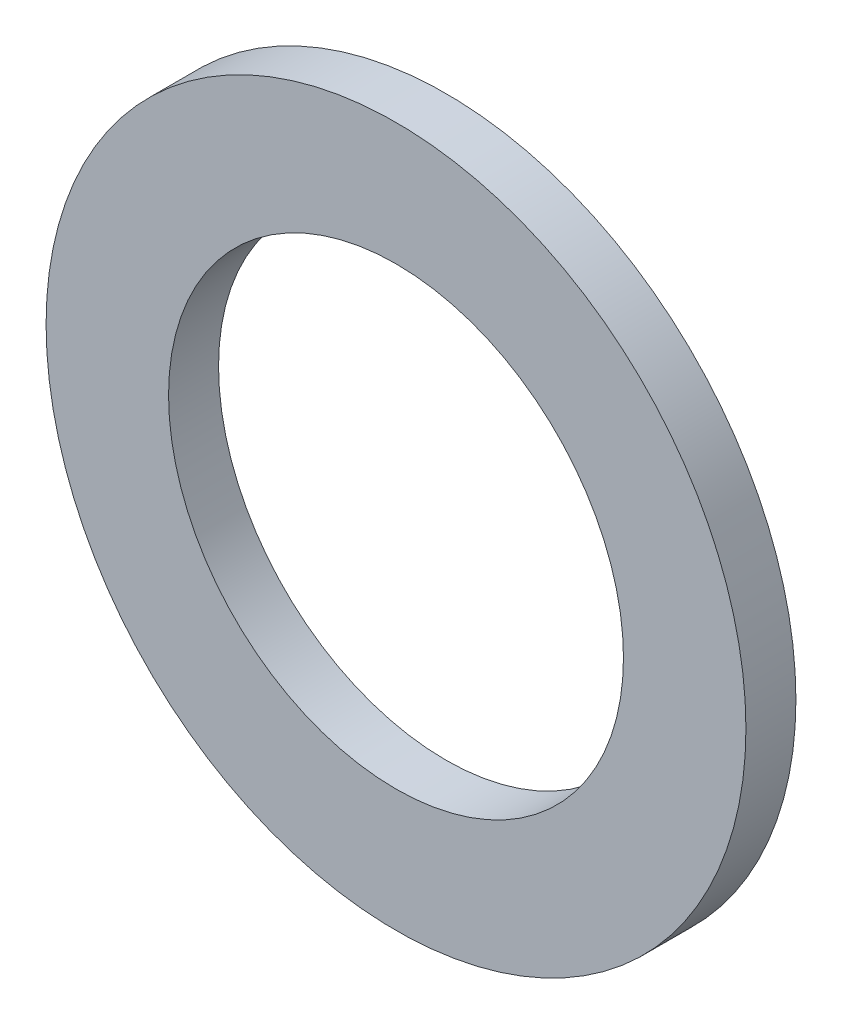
ISO-10303-21;
HEADER;
FILE_DESCRIPTION(('STEP AP214'),'2;1');
FILE_NAME('part.step','',(''),(''),'','','');
FILE_SCHEMA(('AUTOMOTIVE_DESIGN { 1 0 10303 214 1 1 1 1 }'));
ENDSEC;
DATA;
#1=APPLICATION_CONTEXT('core data for automotive mechanical design processes');
#2=APPLICATION_PROTOCOL_DEFINITION('international standard','automotive_design',2000,#1);
#3=PRODUCT_CONTEXT('',#1,'mechanical');
#4=PRODUCT('Part','Part','',(#3));
#5=PRODUCT_RELATED_PRODUCT_CATEGORY('part','',(#4));
#6=PRODUCT_DEFINITION_FORMATION('','',#4);
#7=PRODUCT_DEFINITION_CONTEXT('part definition',#1,'design');
#8=PRODUCT_DEFINITION('design','',#6,#7);
#9=PRODUCT_DEFINITION_SHAPE('','',#8);
#10=(LENGTH_UNIT() NAMED_UNIT(*) SI_UNIT(.MILLI.,.METRE.));
#11=(NAMED_UNIT(*) PLANE_ANGLE_UNIT() SI_UNIT($,.RADIAN.));
#12=(NAMED_UNIT(*) SI_UNIT($,.STERADIAN.) SOLID_ANGLE_UNIT());
#13=UNCERTAINTY_MEASURE_WITH_UNIT(LENGTH_MEASURE(1.E-05),#10,'distance_accuracy_value','');
#14=(GEOMETRIC_REPRESENTATION_CONTEXT(3) GLOBAL_UNCERTAINTY_ASSIGNED_CONTEXT((#13)) GLOBAL_UNIT_ASSIGNED_CONTEXT((#10,
#11,#12)) REPRESENTATION_CONTEXT('',''));
#15=CARTESIAN_POINT('',(0.,0.,0.));
#16=DIRECTION('',(0.,0.,1.));
#17=DIRECTION('',(1.,0.,0.));
#18=AXIS2_PLACEMENT_3D('',#15,#16,#17);
#19=CARTESIAN_POINT('',(0.,0.,2.));
#20=DIRECTION('',(0.,0.,1.));
#21=DIRECTION('',(1.,0.,0.));
#22=AXIS2_PLACEMENT_3D('',#19,#20,#21);
#23=PLANE('',#22);
#24=CARTESIAN_POINT('',(0.,0.,2.));
#25=DIRECTION('',(0.,0.,1.));
#26=DIRECTION('',(1.,0.,0.));
#27=AXIS2_PLACEMENT_3D('',#24,#25,#26);
#28=CIRCLE('',#27,14.);
#29=CARTESIAN_POINT('',(14.,0.,2.));
#30=VERTEX_POINT('',#29);
#31=EDGE_CURVE('E10',#30,#30,#28,.T.);
#32=ORIENTED_EDGE('',*,*,#31,.T.);
#33=EDGE_LOOP('',(#32));
#34=FACE_BOUND('',#33,.T.);
#35=CARTESIAN_POINT('',(0.,0.,2.));
#36=DIRECTION('',(0.,0.,1.));
#37=DIRECTION('',(1.,0.,0.));
#38=AXIS2_PLACEMENT_3D('',#35,#36,#37);
#39=CIRCLE('',#38,9.1);
#40=CARTESIAN_POINT('',(9.1,0.,2.));
#41=VERTEX_POINT('',#40);
#42=EDGE_CURVE('E40',#41,#41,#39,.T.);
#43=ORIENTED_EDGE('',*,*,#42,.F.);
#44=EDGE_LOOP('',(#43));
#45=FACE_BOUND('',#44,.T.);
#46=ADVANCED_FACE('F29',(#34,#45),#23,.T.);
#47=CARTESIAN_POINT('',(0.,0.,0.));
#48=DIRECTION('',(0.,0.,1.));
#49=DIRECTION('',(1.,0.,0.));
#50=AXIS2_PLACEMENT_3D('',#47,#48,#49);
#51=PLANE('',#50);
#52=CARTESIAN_POINT('',(0.,0.,0.));
#53=DIRECTION('',(0.,0.,1.));
#54=DIRECTION('',(1.,0.,0.));
#55=AXIS2_PLACEMENT_3D('',#52,#53,#54);
#56=CIRCLE('',#55,14.);
#57=CARTESIAN_POINT('',(14.,0.,0.));
#58=VERTEX_POINT('',#57);
#59=EDGE_CURVE('E36',#58,#58,#56,.T.);
#60=ORIENTED_EDGE('',*,*,#59,.F.);
#61=EDGE_LOOP('',(#60));
#62=FACE_BOUND('',#61,.T.);
#63=CARTESIAN_POINT('',(0.,0.,0.));
#64=DIRECTION('',(0.,0.,1.));
#65=DIRECTION('',(1.,0.,0.));
#66=AXIS2_PLACEMENT_3D('',#63,#64,#65);
#67=CIRCLE('',#66,9.1);
#68=CARTESIAN_POINT('',(9.1,0.,0.));
#69=VERTEX_POINT('',#68);
#70=EDGE_CURVE('E44',#69,#69,#67,.T.);
#71=ORIENTED_EDGE('',*,*,#70,.T.);
#72=EDGE_LOOP('',(#71));
#73=FACE_BOUND('',#72,.T.);
#74=ADVANCED_FACE('F50',(#62,#73),#51,.F.);
#75=CARTESIAN_POINT('',(0.,0.,2.));
#76=DIRECTION('',(0.,0.,-1.));
#77=DIRECTION('',(-1.,0.,0.));
#78=AXIS2_PLACEMENT_3D('',#75,#76,#77);
#79=CYLINDRICAL_SURFACE('',#78,14.);
#80=ORIENTED_EDGE('',*,*,#31,.F.);
#81=EDGE_LOOP('',(#80));
#82=FACE_BOUND('',#81,.T.);
#83=ORIENTED_EDGE('',*,*,#59,.T.);
#84=EDGE_LOOP('',(#83));
#85=FACE_BOUND('',#84,.T.);
#86=ADVANCED_FACE('F31',(#82,#85),#79,.T.);
#87=CARTESIAN_POINT('',(0.,0.,2.));
#88=DIRECTION('',(0.,0.,-1.));
#89=DIRECTION('',(-1.,0.,0.));
#90=AXIS2_PLACEMENT_3D('',#87,#88,#89);
#91=CYLINDRICAL_SURFACE('',#90,9.1);
#92=ORIENTED_EDGE('',*,*,#42,.T.);
#93=EDGE_LOOP('',(#92));
#94=FACE_BOUND('',#93,.T.);
#95=ORIENTED_EDGE('',*,*,#70,.F.);
#96=EDGE_LOOP('',(#95));
#97=FACE_BOUND('',#96,.T.);
#98=ADVANCED_FACE('F52',(#94,#97),#91,.F.);
#99=CLOSED_SHELL('',(#46,#74,#86,#98));
#100=MANIFOLD_SOLID_BREP('B2',#99);
#101=ADVANCED_BREP_SHAPE_REPRESENTATION('',(#18,#100),#14);
#102=SHAPE_DEFINITION_REPRESENTATION(#9,#101);
ENDSEC;
END-ISO-10303-21;
